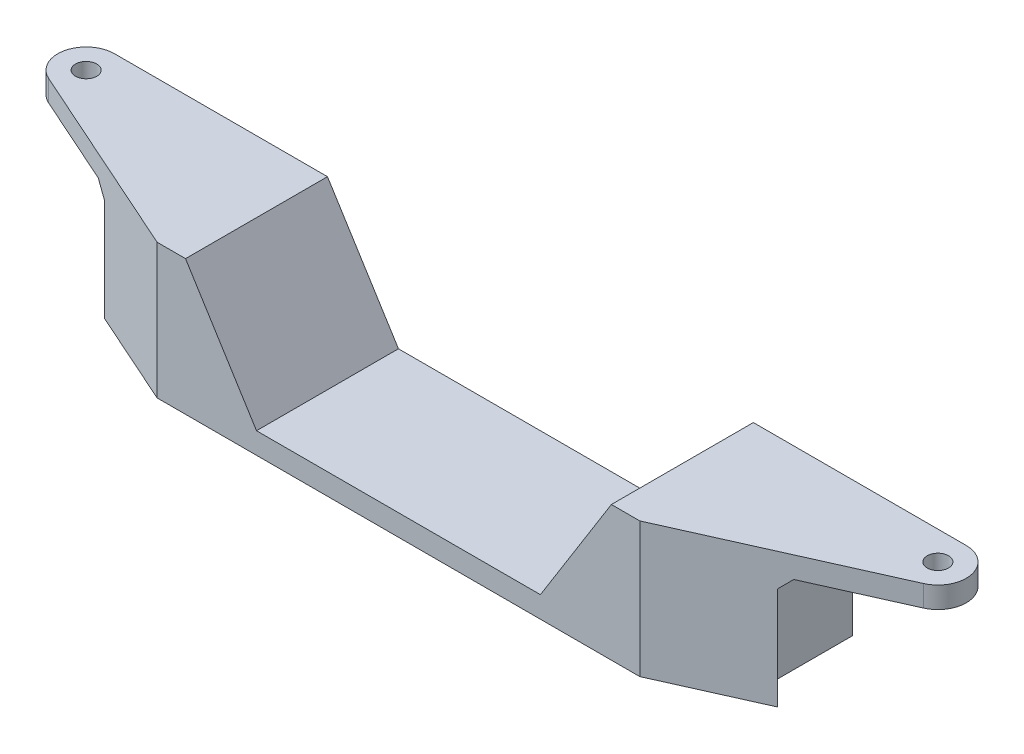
ISO-10303-21;
HEADER;
FILE_DESCRIPTION(('STEP AP214'),'2;1');
FILE_NAME('part.step','',(''),(''),'','','');
FILE_SCHEMA(('AUTOMOTIVE_DESIGN { 1 0 10303 214 1 1 1 1 }'));
ENDSEC;
DATA;
#1=APPLICATION_CONTEXT('core data for automotive mechanical design processes');
#2=APPLICATION_PROTOCOL_DEFINITION('international standard','automotive_design',2000,#1);
#3=PRODUCT_CONTEXT('',#1,'mechanical');
#4=PRODUCT('Part','Part','',(#3));
#5=PRODUCT_RELATED_PRODUCT_CATEGORY('part','',(#4));
#6=PRODUCT_DEFINITION_FORMATION('','',#4);
#7=PRODUCT_DEFINITION_CONTEXT('part definition',#1,'design');
#8=PRODUCT_DEFINITION('design','',#6,#7);
#9=PRODUCT_DEFINITION_SHAPE('','',#8);
#10=(LENGTH_UNIT() NAMED_UNIT(*) SI_UNIT(.MILLI.,.METRE.));
#11=(NAMED_UNIT(*) PLANE_ANGLE_UNIT() SI_UNIT($,.RADIAN.));
#12=(NAMED_UNIT(*) SI_UNIT($,.STERADIAN.) SOLID_ANGLE_UNIT());
#13=UNCERTAINTY_MEASURE_WITH_UNIT(LENGTH_MEASURE(1.E-05),#10,'distance_accuracy_value','');
#14=(GEOMETRIC_REPRESENTATION_CONTEXT(3) GLOBAL_UNCERTAINTY_ASSIGNED_CONTEXT((#13)) GLOBAL_UNIT_ASSIGNED_CONTEXT((#10,
#11,#12)) REPRESENTATION_CONTEXT('',''));
#15=CARTESIAN_POINT('',(0.,0.,0.));
#16=DIRECTION('',(0.,0.,1.));
#17=DIRECTION('',(1.,0.,0.));
#18=AXIS2_PLACEMENT_3D('',#15,#16,#17);
#19=CARTESIAN_POINT('',(60.,-8.,-4.00000000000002));
#20=DIRECTION('',(0.,1.,0.));
#21=DIRECTION('',(-1.,0.,0.));
#22=AXIS2_PLACEMENT_3D('',#19,#20,#21);
#23=PLANE('',#22);
#24=DIRECTION('',(-0.912985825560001,0.,-0.407991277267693));
#25=VECTOR('',#24,1.);
#26=CARTESIAN_POINT('',(-34.,-8.00000000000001,16.));
#27=LINE('',#26,#25);
#28=CARTESIAN_POINT('',(-34.,-8.,16.));
#29=VERTEX_POINT('',#28);
#30=CARTESIAN_POINT('',(-47.4265491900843,-8.,10.));
#31=VERTEX_POINT('',#30);
#32=EDGE_CURVE('E169',#29,#31,#27,.T.);
#33=ORIENTED_EDGE('',*,*,#32,.T.);
#34=DIRECTION('',(-1.,0.,0.));
#35=VECTOR('',#34,1.);
#36=CARTESIAN_POINT('',(-64.,-8.,10.));
#37=LINE('',#36,#35);
#38=CARTESIAN_POINT('',(-44.,-8.,10.));
#39=VERTEX_POINT('',#38);
#40=EDGE_CURVE('E167',#39,#31,#37,.T.);
#41=ORIENTED_EDGE('',*,*,#40,.F.);
#42=DIRECTION('',(0.,0.,-1.));
#43=VECTOR('',#42,1.);
#44=CARTESIAN_POINT('',(-44.,-8.,10.));
#45=LINE('',#44,#43);
#46=CARTESIAN_POINT('',(-44.,-8.,-4.00000000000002));
#47=VERTEX_POINT('',#46);
#48=EDGE_CURVE('E11',#39,#47,#45,.T.);
#49=ORIENTED_EDGE('',*,*,#48,.T.);
#50=DIRECTION('',(1.,0.,0.));
#51=VECTOR('',#50,1.);
#52=CARTESIAN_POINT('',(-60.,-8.00000000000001,-4.00000000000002));
#53=LINE('',#52,#51);
#54=CARTESIAN_POINT('',(44.,-8.,-4.00000000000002));
#55=VERTEX_POINT('',#54);
#56=EDGE_CURVE('E46',#47,#55,#53,.T.);
#57=ORIENTED_EDGE('',*,*,#56,.T.);
#58=DIRECTION('',(0.,0.,-1.));
#59=VECTOR('',#58,1.);
#60=CARTESIAN_POINT('',(44.,-8.,10.));
#61=LINE('',#60,#59);
#62=CARTESIAN_POINT('',(44.,-8.,10.));
#63=VERTEX_POINT('',#62);
#64=EDGE_CURVE('E210',#63,#55,#61,.T.);
#65=ORIENTED_EDGE('',*,*,#64,.F.);
#66=DIRECTION('',(1.,0.,0.));
#67=VECTOR('',#66,1.);
#68=CARTESIAN_POINT('',(64.,-8.,10.));
#69=LINE('',#68,#67);
#70=CARTESIAN_POINT('',(47.4265491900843,-8.,10.));
#71=VERTEX_POINT('',#70);
#72=EDGE_CURVE('E38',#63,#71,#69,.T.);
#73=ORIENTED_EDGE('',*,*,#72,.T.);
#74=DIRECTION('',(-0.912985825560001,0.,0.407991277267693));
#75=VECTOR('',#74,1.);
#76=CARTESIAN_POINT('',(34.,-8.,16.));
#77=LINE('',#76,#75);
#78=CARTESIAN_POINT('',(34.,-8.,16.));
#79=VERTEX_POINT('',#78);
#80=EDGE_CURVE('E292',#71,#79,#77,.T.);
#81=ORIENTED_EDGE('',*,*,#80,.T.);
#82=DIRECTION('',(-1.,0.,0.));
#83=VECTOR('',#82,1.);
#84=CARTESIAN_POINT('',(-34.,-8.00000000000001,16.));
#85=LINE('',#84,#83);
#86=EDGE_CURVE('E33',#79,#29,#85,.T.);
#87=ORIENTED_EDGE('',*,*,#86,.T.);
#88=EDGE_LOOP('',(#33,#41,#49,#57,#65,#73,#81,#87));
#89=FACE_BOUND('',#88,.T.);
#90=ADVANCED_FACE('F30',(#89),#23,.F.);
#91=CARTESIAN_POINT('',(-60.,-18.,0.));
#92=DIRECTION('',(0.,1.,0.));
#93=DIRECTION('',(0.,0.,1.));
#94=AXIS2_PLACEMENT_3D('',#91,#92,#93);
#95=CYLINDRICAL_SURFACE('',#94,1.5);
#96=CARTESIAN_POINT('',(-60.,11.,0.));
#97=DIRECTION('',(0.,-1.,0.));
#98=DIRECTION('',(0.,0.,1.));
#99=AXIS2_PLACEMENT_3D('',#96,#97,#98);
#100=CIRCLE('',#99,1.5);
#101=CARTESIAN_POINT('',(-60.,11.,1.49999999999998));
#102=VERTEX_POINT('',#101);
#103=EDGE_CURVE('E326',#102,#102,#100,.T.);
#104=ORIENTED_EDGE('',*,*,#103,.F.);
#105=EDGE_LOOP('',(#104));
#106=FACE_BOUND('',#105,.T.);
#107=CARTESIAN_POINT('',(-60.,8.,0.));
#108=DIRECTION('',(0.,1.,0.));
#109=DIRECTION('',(-1.,0.,0.));
#110=AXIS2_PLACEMENT_3D('',#107,#108,#109);
#111=CIRCLE('',#110,1.5);
#112=CARTESIAN_POINT('',(-61.5,8.,0.));
#113=VERTEX_POINT('',#112);
#114=EDGE_CURVE('E321',#113,#113,#111,.F.);
#115=ORIENTED_EDGE('',*,*,#114,.T.);
#116=EDGE_LOOP('',(#115));
#117=FACE_BOUND('',#116,.T.);
#118=ADVANCED_FACE('F330',(#106,#117),#95,.F.);
#119=CARTESIAN_POINT('',(60.,-18.,0.));
#120=DIRECTION('',(0.,1.,0.));
#121=DIRECTION('',(0.,0.,1.));
#122=AXIS2_PLACEMENT_3D('',#119,#120,#121);
#123=CYLINDRICAL_SURFACE('',#122,1.5);
#124=CARTESIAN_POINT('',(60.,8.,0.));
#125=DIRECTION('',(0.,-1.,0.));
#126=DIRECTION('',(1.,0.,0.));
#127=AXIS2_PLACEMENT_3D('',#124,#125,#126);
#128=CIRCLE('',#127,1.5);
#129=CARTESIAN_POINT('',(61.5,8.,0.));
#130=VERTEX_POINT('',#129);
#131=EDGE_CURVE('E186',#130,#130,#128,.T.);
#132=ORIENTED_EDGE('',*,*,#131,.T.);
#133=EDGE_LOOP('',(#132));
#134=FACE_BOUND('',#133,.T.);
#135=CARTESIAN_POINT('',(60.,11.,0.));
#136=DIRECTION('',(0.,1.,0.));
#137=DIRECTION('',(0.,0.,1.));
#138=AXIS2_PLACEMENT_3D('',#135,#136,#137);
#139=CIRCLE('',#138,1.5);
#140=CARTESIAN_POINT('',(60.,11.,1.49999999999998));
#141=VERTEX_POINT('',#140);
#142=EDGE_CURVE('E180',#141,#141,#139,.T.);
#143=ORIENTED_EDGE('',*,*,#142,.T.);
#144=EDGE_LOOP('',(#143));
#145=FACE_BOUND('',#144,.T.);
#146=ADVANCED_FACE('F333',(#134,#145),#123,.F.);
#147=CARTESIAN_POINT('',(-64.,8.,10.));
#148=DIRECTION('',(0.,1.,0.));
#149=DIRECTION('',(-1.,0.,0.));
#150=AXIS2_PLACEMENT_3D('',#147,#148,#149);
#151=PLANE('',#150);
#152=DIRECTION('',(1.,0.,0.));
#153=VECTOR('',#152,1.);
#154=CARTESIAN_POINT('',(-64.,8.,-4.00000000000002));
#155=LINE('',#154,#153);
#156=CARTESIAN_POINT('',(-60.,8.,-4.00000000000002));
#157=VERTEX_POINT('',#156);
#158=CARTESIAN_POINT('',(-49.,8.,-4.00000000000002));
#159=VERTEX_POINT('',#158);
#160=EDGE_CURVE('E173',#157,#159,#155,.T.);
#161=ORIENTED_EDGE('',*,*,#160,.T.);
#162=DIRECTION('',(0.,0.,1.));
#163=VECTOR('',#162,1.);
#164=CARTESIAN_POINT('',(-49.,8.,10.));
#165=LINE('',#164,#163);
#166=CARTESIAN_POINT('',(-49.,8.,9.29686290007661));
#167=VERTEX_POINT('',#166);
#168=EDGE_CURVE('E284',#159,#167,#165,.T.);
#169=ORIENTED_EDGE('',*,*,#168,.T.);
#170=DIRECTION('',(-0.912985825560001,0.,-0.407991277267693));
#171=VECTOR('',#170,1.);
#172=CARTESIAN_POINT('',(-34.,8.,16.));
#173=LINE('',#172,#171);
#174=CARTESIAN_POINT('',(-61.6319651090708,8.,3.65194330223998));
#175=VERTEX_POINT('',#174);
#176=EDGE_CURVE('E280',#167,#175,#173,.T.);
#177=ORIENTED_EDGE('',*,*,#176,.T.);
#178=CARTESIAN_POINT('',(-60.,8.,0.));
#179=DIRECTION('',(0.,1.,0.));
#180=DIRECTION('',(-1.,0.,0.));
#181=AXIS2_PLACEMENT_3D('',#178,#179,#180);
#182=CIRCLE('',#181,4.);
#183=EDGE_CURVE('E178',#175,#157,#182,.F.);
#184=ORIENTED_EDGE('',*,*,#183,.T.);
#185=EDGE_LOOP('',(#161,#169,#177,#184));
#186=FACE_BOUND('',#185,.T.);
#187=ORIENTED_EDGE('',*,*,#114,.F.);
#188=EDGE_LOOP('',(#187));
#189=FACE_BOUND('',#188,.T.);
#190=ADVANCED_FACE('F317',(#186,#189),#151,.F.);
#191=CARTESIAN_POINT('',(-60.,11.,0.));
#192=DIRECTION('',(0.,-1.,0.));
#193=DIRECTION('',(0.,0.,-1.));
#194=AXIS2_PLACEMENT_3D('',#191,#192,#193);
#195=CYLINDRICAL_SURFACE('',#194,4.);
#196=ORIENTED_EDGE('',*,*,#183,.F.);
#197=DIRECTION('',(0.,-1.,0.));
#198=VECTOR('',#197,1.);
#199=CARTESIAN_POINT('',(-61.6319651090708,11.,3.65194330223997));
#200=LINE('',#199,#198);
#201=CARTESIAN_POINT('',(-61.6319651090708,11.,3.65194330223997));
#202=VERTEX_POINT('',#201);
#203=EDGE_CURVE('E248',#202,#175,#200,.T.);
#204=ORIENTED_EDGE('',*,*,#203,.F.);
#205=CARTESIAN_POINT('',(-60.,11.,0.));
#206=DIRECTION('',(0.,-1.,0.));
#207=DIRECTION('',(0.,0.,-1.));
#208=AXIS2_PLACEMENT_3D('',#205,#206,#207);
#209=CIRCLE('',#208,4.);
#210=CARTESIAN_POINT('',(-60.,11.,-4.00000000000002));
#211=VERTEX_POINT('',#210);
#212=EDGE_CURVE('E227',#202,#211,#209,.T.);
#213=ORIENTED_EDGE('',*,*,#212,.T.);
#214=DIRECTION('',(0.,-1.,0.));
#215=VECTOR('',#214,1.);
#216=CARTESIAN_POINT('',(-60.,11.,-4.00000000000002));
#217=LINE('',#216,#215);
#218=EDGE_CURVE('E245',#211,#157,#217,.T.);
#219=ORIENTED_EDGE('',*,*,#218,.T.);
#220=EDGE_LOOP('',(#196,#204,#213,#219));
#221=FACE_BOUND('',#220,.T.);
#222=ADVANCED_FACE('F313',(#221),#195,.T.);
#223=CARTESIAN_POINT('',(60.,11.,0.));
#224=DIRECTION('',(0.,-1.,0.));
#225=DIRECTION('',(0.,0.,-1.));
#226=AXIS2_PLACEMENT_3D('',#223,#224,#225);
#227=CYLINDRICAL_SURFACE('',#226,4.);
#228=CARTESIAN_POINT('',(60.,8.,0.));
#229=DIRECTION('',(0.,-1.,0.));
#230=DIRECTION('',(1.,0.,0.));
#231=AXIS2_PLACEMENT_3D('',#228,#229,#230);
#232=CIRCLE('',#231,4.);
#233=CARTESIAN_POINT('',(61.6319651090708,8.,3.65194330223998));
#234=VERTEX_POINT('',#233);
#235=CARTESIAN_POINT('',(60.,8.,-4.00000000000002));
#236=VERTEX_POINT('',#235);
#237=EDGE_CURVE('E213',#234,#236,#232,.F.);
#238=ORIENTED_EDGE('',*,*,#237,.T.);
#239=DIRECTION('',(0.,-1.,0.));
#240=VECTOR('',#239,1.);
#241=CARTESIAN_POINT('',(60.,11.,-4.00000000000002));
#242=LINE('',#241,#240);
#243=CARTESIAN_POINT('',(60.,11.,-4.00000000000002));
#244=VERTEX_POINT('',#243);
#245=EDGE_CURVE('E242',#244,#236,#242,.T.);
#246=ORIENTED_EDGE('',*,*,#245,.F.);
#247=CARTESIAN_POINT('',(60.,11.,0.));
#248=DIRECTION('',(0.,-1.,0.));
#249=DIRECTION('',(0.,0.,1.));
#250=AXIS2_PLACEMENT_3D('',#247,#248,#249);
#251=CIRCLE('',#250,4.);
#252=CARTESIAN_POINT('',(61.6319651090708,11.,3.65194330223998));
#253=VERTEX_POINT('',#252);
#254=EDGE_CURVE('E234',#244,#253,#251,.T.);
#255=ORIENTED_EDGE('',*,*,#254,.T.);
#256=DIRECTION('',(0.,-1.,0.));
#257=VECTOR('',#256,1.);
#258=CARTESIAN_POINT('',(61.6319651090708,11.,3.65194330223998));
#259=LINE('',#258,#257);
#260=EDGE_CURVE('E238',#253,#234,#259,.T.);
#261=ORIENTED_EDGE('',*,*,#260,.T.);
#262=EDGE_LOOP('',(#238,#246,#255,#261));
#263=FACE_BOUND('',#262,.T.);
#264=ADVANCED_FACE('F342',(#263),#227,.T.);
#265=CARTESIAN_POINT('',(64.,8.,10.));
#266=DIRECTION('',(0.,-1.,0.));
#267=DIRECTION('',(1.,0.,0.));
#268=AXIS2_PLACEMENT_3D('',#265,#266,#267);
#269=PLANE('',#268);
#270=ORIENTED_EDGE('',*,*,#131,.F.);
#271=EDGE_LOOP('',(#270));
#272=FACE_BOUND('',#271,.T.);
#273=DIRECTION('',(0.912985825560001,0.,-0.407991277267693));
#274=VECTOR('',#273,1.);
#275=CARTESIAN_POINT('',(34.,8.,16.));
#276=LINE('',#275,#274);
#277=CARTESIAN_POINT('',(49.,8.,9.29686290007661));
#278=VERTEX_POINT('',#277);
#279=EDGE_CURVE('E215',#278,#234,#276,.T.);
#280=ORIENTED_EDGE('',*,*,#279,.F.);
#281=DIRECTION('',(0.,0.,-1.));
#282=VECTOR('',#281,1.);
#283=CARTESIAN_POINT('',(49.,8.,-4.00000000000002));
#284=LINE('',#283,#282);
#285=CARTESIAN_POINT('',(49.,8.,-4.00000000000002));
#286=VERTEX_POINT('',#285);
#287=EDGE_CURVE('E267',#278,#286,#284,.T.);
#288=ORIENTED_EDGE('',*,*,#287,.T.);
#289=DIRECTION('',(-1.,0.,0.));
#290=VECTOR('',#289,1.);
#291=CARTESIAN_POINT('',(-60.,7.99999999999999,-4.00000000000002));
#292=LINE('',#291,#290);
#293=EDGE_CURVE('E257',#236,#286,#292,.T.);
#294=ORIENTED_EDGE('',*,*,#293,.F.);
#295=ORIENTED_EDGE('',*,*,#237,.F.);
#296=EDGE_LOOP('',(#280,#288,#294,#295));
#297=FACE_BOUND('',#296,.T.);
#298=ADVANCED_FACE('F396',(#272,#297),#269,.T.);
#299=CARTESIAN_POINT('',(60.,11.,0.));
#300=DIRECTION('',(0.,1.,0.));
#301=DIRECTION('',(0.,0.,1.));
#302=AXIS2_PLACEMENT_3D('',#299,#300,#301);
#303=PLANE('',#302);
#304=DIRECTION('',(0.,0.,1.));
#305=VECTOR('',#304,1.);
#306=CARTESIAN_POINT('',(-30.,11.,0.));
#307=LINE('',#306,#305);
#308=CARTESIAN_POINT('',(-30.,11.,-4.00000000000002));
#309=VERTEX_POINT('',#308);
#310=CARTESIAN_POINT('',(-30.,11.,16.));
#311=VERTEX_POINT('',#310);
#312=EDGE_CURVE('E265',#309,#311,#307,.T.);
#313=ORIENTED_EDGE('',*,*,#312,.F.);
#314=DIRECTION('',(1.,0.,0.));
#315=VECTOR('',#314,1.);
#316=CARTESIAN_POINT('',(-60.,11.,-4.00000000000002));
#317=LINE('',#316,#315);
#318=EDGE_CURVE('E231',#211,#309,#317,.T.);
#319=ORIENTED_EDGE('',*,*,#318,.F.);
#320=ORIENTED_EDGE('',*,*,#212,.F.);
#321=DIRECTION('',(-0.912985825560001,0.,-0.407991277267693));
#322=VECTOR('',#321,1.);
#323=CARTESIAN_POINT('',(-34.,11.,16.));
#324=LINE('',#323,#322);
#325=CARTESIAN_POINT('',(-34.,11.,16.));
#326=VERTEX_POINT('',#325);
#327=EDGE_CURVE('E224',#326,#202,#324,.T.);
#328=ORIENTED_EDGE('',*,*,#327,.F.);
#329=DIRECTION('',(-1.,0.,0.));
#330=VECTOR('',#329,1.);
#331=CARTESIAN_POINT('',(-34.,11.,16.));
#332=LINE('',#331,#330);
#333=EDGE_CURVE('E220',#311,#326,#332,.T.);
#334=ORIENTED_EDGE('',*,*,#333,.F.);
#335=EDGE_LOOP('',(#313,#319,#320,#328,#334));
#336=FACE_BOUND('',#335,.T.);
#337=ORIENTED_EDGE('',*,*,#103,.T.);
#338=EDGE_LOOP('',(#337));
#339=FACE_BOUND('',#338,.T.);
#340=ADVANCED_FACE('F305',(#336,#339),#303,.T.);
#341=CARTESIAN_POINT('',(-20.,-5.,-8.));
#342=DIRECTION('',(-0.847998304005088,-0.52999894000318,0.));
#343=DIRECTION('',(0.52999894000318,-0.847998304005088,0.));
#344=AXIS2_PLACEMENT_3D('',#341,#342,#343);
#345=PLANE('',#344);
#346=DIRECTION('',(-0.52999894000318,0.847998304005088,0.));
#347=VECTOR('',#346,1.);
#348=CARTESIAN_POINT('',(-38.4269662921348,24.4831460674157,-4.00000000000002));
#349=LINE('',#348,#347);
#350=CARTESIAN_POINT('',(-20.,-5.,-4.00000000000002));
#351=VERTEX_POINT('',#350);
#352=EDGE_CURVE('E203',#351,#309,#349,.T.);
#353=ORIENTED_EDGE('',*,*,#352,.T.);
#354=ORIENTED_EDGE('',*,*,#312,.T.);
#355=DIRECTION('',(0.52999894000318,-0.847998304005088,0.));
#356=VECTOR('',#355,1.);
#357=CARTESIAN_POINT('',(-20.,-5.,16.));
#358=LINE('',#357,#356);
#359=CARTESIAN_POINT('',(-20.,-5.,16.));
#360=VERTEX_POINT('',#359);
#361=EDGE_CURVE('E194',#311,#360,#358,.T.);
#362=ORIENTED_EDGE('',*,*,#361,.T.);
#363=DIRECTION('',(0.,0.,1.));
#364=VECTOR('',#363,1.);
#365=CARTESIAN_POINT('',(-20.,-5.,-8.));
#366=LINE('',#365,#364);
#367=EDGE_CURVE('E198',#351,#360,#366,.T.);
#368=ORIENTED_EDGE('',*,*,#367,.F.);
#369=EDGE_LOOP('',(#353,#354,#362,#368));
#370=FACE_BOUND('',#369,.T.);
#371=ADVANCED_FACE('F381',(#370),#345,.F.);
#372=CARTESIAN_POINT('',(-20.,-5.,-8.));
#373=DIRECTION('',(0.,-1.,0.));
#374=DIRECTION('',(0.,0.,-1.));
#375=AXIS2_PLACEMENT_3D('',#372,#373,#374);
#376=PLANE('',#375);
#377=DIRECTION('',(-1.,0.,0.));
#378=VECTOR('',#377,1.);
#379=CARTESIAN_POINT('',(-60.,-5.,-4.00000000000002));
#380=LINE('',#379,#378);
#381=CARTESIAN_POINT('',(20.,-5.,-4.00000000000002));
#382=VERTEX_POINT('',#381);
#383=EDGE_CURVE('E205',#382,#351,#380,.T.);
#384=ORIENTED_EDGE('',*,*,#383,.T.);
#385=ORIENTED_EDGE('',*,*,#367,.T.);
#386=DIRECTION('',(1.,0.,0.));
#387=VECTOR('',#386,1.);
#388=CARTESIAN_POINT('',(-20.,-5.,16.));
#389=LINE('',#388,#387);
#390=CARTESIAN_POINT('',(20.,-5.,16.));
#391=VERTEX_POINT('',#390);
#392=EDGE_CURVE('E189',#360,#391,#389,.T.);
#393=ORIENTED_EDGE('',*,*,#392,.T.);
#394=DIRECTION('',(0.,0.,1.));
#395=VECTOR('',#394,1.);
#396=CARTESIAN_POINT('',(20.,-5.,-8.));
#397=LINE('',#396,#395);
#398=EDGE_CURVE('E197',#382,#391,#397,.T.);
#399=ORIENTED_EDGE('',*,*,#398,.F.);
#400=EDGE_LOOP('',(#384,#385,#393,#399));
#401=FACE_BOUND('',#400,.T.);
#402=ADVANCED_FACE('F384',(#401),#376,.F.);
#403=CARTESIAN_POINT('',(20.,-5.,-8.));
#404=DIRECTION('',(0.847998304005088,-0.52999894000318,0.));
#405=DIRECTION('',(0.52999894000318,0.847998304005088,0.));
#406=AXIS2_PLACEMENT_3D('',#403,#404,#405);
#407=PLANE('',#406);
#408=DIRECTION('',(-0.52999894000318,-0.847998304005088,0.));
#409=VECTOR('',#408,1.);
#410=CARTESIAN_POINT('',(4.7191011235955,-29.4494382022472,-4.00000000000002));
#411=LINE('',#410,#409);
#412=CARTESIAN_POINT('',(30.,11.,-4.00000000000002));
#413=VERTEX_POINT('',#412);
#414=EDGE_CURVE('E200',#413,#382,#411,.T.);
#415=ORIENTED_EDGE('',*,*,#414,.T.);
#416=ORIENTED_EDGE('',*,*,#398,.T.);
#417=DIRECTION('',(0.52999894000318,0.847998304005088,0.));
#418=VECTOR('',#417,1.);
#419=CARTESIAN_POINT('',(20.,-5.,16.));
#420=LINE('',#419,#418);
#421=CARTESIAN_POINT('',(30.,11.,16.));
#422=VERTEX_POINT('',#421);
#423=EDGE_CURVE('E192',#391,#422,#420,.T.);
#424=ORIENTED_EDGE('',*,*,#423,.T.);
#425=DIRECTION('',(0.,0.,-1.));
#426=VECTOR('',#425,1.);
#427=CARTESIAN_POINT('',(30.,11.,0.));
#428=LINE('',#427,#426);
#429=EDGE_CURVE('E263',#422,#413,#428,.T.);
#430=ORIENTED_EDGE('',*,*,#429,.T.);
#431=EDGE_LOOP('',(#415,#416,#424,#430));
#432=FACE_BOUND('',#431,.T.);
#433=ADVANCED_FACE('F386',(#432),#407,.F.);
#434=ORIENTED_EDGE('',*,*,#142,.F.);
#435=EDGE_LOOP('',(#434));
#436=FACE_BOUND('',#435,.T.);
#437=ORIENTED_EDGE('',*,*,#429,.F.);
#438=CARTESIAN_POINT('',(34.,11.,16.));
#439=VERTEX_POINT('',#438);
#440=EDGE_CURVE('E221',#439,#422,#332,.T.);
#441=ORIENTED_EDGE('',*,*,#440,.F.);
#442=DIRECTION('',(-0.912985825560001,0.,0.407991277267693));
#443=VECTOR('',#442,1.);
#444=CARTESIAN_POINT('',(34.,11.,16.));
#445=LINE('',#444,#443);
#446=EDGE_CURVE('E217',#253,#439,#445,.T.);
#447=ORIENTED_EDGE('',*,*,#446,.F.);
#448=ORIENTED_EDGE('',*,*,#254,.F.);
#449=EDGE_CURVE('E230',#413,#244,#317,.T.);
#450=ORIENTED_EDGE('',*,*,#449,.F.);
#451=EDGE_LOOP('',(#437,#441,#447,#448,#450));
#452=FACE_BOUND('',#451,.T.);
#453=ADVANCED_FACE('F378',(#436,#452),#303,.T.);
#454=CARTESIAN_POINT('',(-60.,11.,-4.00000000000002));
#455=DIRECTION('',(0.,0.,-1.));
#456=DIRECTION('',(-1.,0.,0.));
#457=AXIS2_PLACEMENT_3D('',#454,#455,#456);
#458=PLANE('',#457);
#459=ORIENTED_EDGE('',*,*,#56,.F.);
#460=DIRECTION('',(0.,-1.,0.));
#461=VECTOR('',#460,1.);
#462=CARTESIAN_POINT('',(-44.,8.,-4.00000000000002));
#463=LINE('',#462,#461);
#464=CARTESIAN_POINT('',(-44.,3.00000000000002,-4.00000000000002));
#465=VERTEX_POINT('',#464);
#466=EDGE_CURVE('E164',#465,#47,#463,.T.);
#467=ORIENTED_EDGE('',*,*,#466,.F.);
#468=DIRECTION('',(0.707106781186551,-0.707106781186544,0.));
#469=VECTOR('',#468,1.);
#470=CARTESIAN_POINT('',(-44.,3.00000000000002,-4.00000000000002));
#471=LINE('',#470,#469);
#472=EDGE_CURVE('E287',#465,#159,#471,.F.);
#473=ORIENTED_EDGE('',*,*,#472,.T.);
#474=ORIENTED_EDGE('',*,*,#160,.F.);
#475=ORIENTED_EDGE('',*,*,#218,.F.);
#476=ORIENTED_EDGE('',*,*,#318,.T.);
#477=ORIENTED_EDGE('',*,*,#352,.F.);
#478=ORIENTED_EDGE('',*,*,#383,.F.);
#479=ORIENTED_EDGE('',*,*,#414,.F.);
#480=ORIENTED_EDGE('',*,*,#449,.T.);
#481=ORIENTED_EDGE('',*,*,#245,.T.);
#482=ORIENTED_EDGE('',*,*,#293,.T.);
#483=DIRECTION('',(0.707106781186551,0.707106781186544,0.));
#484=VECTOR('',#483,1.);
#485=CARTESIAN_POINT('',(49.,8.,-4.00000000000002));
#486=LINE('',#485,#484);
#487=CARTESIAN_POINT('',(44.,3.00000000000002,-4.00000000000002));
#488=VERTEX_POINT('',#487);
#489=EDGE_CURVE('E274',#286,#488,#486,.F.);
#490=ORIENTED_EDGE('',*,*,#489,.T.);
#491=DIRECTION('',(0.,-1.,0.));
#492=VECTOR('',#491,1.);
#493=CARTESIAN_POINT('',(44.,11.,-4.00000000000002));
#494=LINE('',#493,#492);
#495=EDGE_CURVE('E241',#488,#55,#494,.T.);
#496=ORIENTED_EDGE('',*,*,#495,.T.);
#497=EDGE_LOOP('',(#459,#467,#473,#474,#475,#476,#477,#478,#479,#480,#481,#482,#490,#496));
#498=FACE_BOUND('',#497,.T.);
#499=ADVANCED_FACE('F320',(#498),#458,.T.);
#500=CARTESIAN_POINT('',(-44.,8.,10.));
#501=DIRECTION('',(1.,0.,0.));
#502=DIRECTION('',(0.,0.,-1.));
#503=AXIS2_PLACEMENT_3D('',#500,#501,#502);
#504=PLANE('',#503);
#505=DIRECTION('',(0.,-1.,0.));
#506=VECTOR('',#505,1.);
#507=CARTESIAN_POINT('',(-44.,8.,10.));
#508=LINE('',#507,#506);
#509=CARTESIAN_POINT('',(-44.,3.00000000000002,10.));
#510=VERTEX_POINT('',#509);
#511=EDGE_CURVE('E162',#510,#39,#508,.T.);
#512=ORIENTED_EDGE('',*,*,#511,.F.);
#513=DIRECTION('',(0.,0.,-1.));
#514=VECTOR('',#513,1.);
#515=CARTESIAN_POINT('',(-44.,3.00000000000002,-4.00000000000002));
#516=LINE('',#515,#514);
#517=EDGE_CURVE('E282',#510,#465,#516,.T.);
#518=ORIENTED_EDGE('',*,*,#517,.T.);
#519=ORIENTED_EDGE('',*,*,#466,.T.);
#520=ORIENTED_EDGE('',*,*,#48,.F.);
#521=EDGE_LOOP('',(#512,#518,#519,#520));
#522=FACE_BOUND('',#521,.T.);
#523=ADVANCED_FACE('F159',(#522),#504,.F.);
#524=CARTESIAN_POINT('',(-44.,3.00000000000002,10.));
#525=DIRECTION('',(-0.707106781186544,-0.707106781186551,0.));
#526=DIRECTION('',(0.707106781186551,-0.707106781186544,0.));
#527=AXIS2_PLACEMENT_3D('',#524,#525,#526);
#528=PLANE('',#527);
#529=DIRECTION('',(-0.67424614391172,0.674246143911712,-0.301304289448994));
#530=VECTOR('',#529,1.);
#531=CARTESIAN_POINT('',(-44.3110767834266,3.31107678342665,11.392229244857));
#532=LINE('',#531,#530);
#533=CARTESIAN_POINT('',(-47.4265491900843,6.42654919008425,10.));
#534=VERTEX_POINT('',#533);
#535=EDGE_CURVE('E289',#167,#534,#532,.F.);
#536=ORIENTED_EDGE('',*,*,#535,.F.);
#537=ORIENTED_EDGE('',*,*,#168,.F.);
#538=ORIENTED_EDGE('',*,*,#472,.F.);
#539=ORIENTED_EDGE('',*,*,#517,.F.);
#540=DIRECTION('',(-0.707106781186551,0.707106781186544,0.));
#541=VECTOR('',#540,1.);
#542=CARTESIAN_POINT('',(-48.5000000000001,7.50000000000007,10.));
#543=LINE('',#542,#541);
#544=EDGE_CURVE('E177',#534,#510,#543,.F.);
#545=ORIENTED_EDGE('',*,*,#544,.F.);
#546=EDGE_LOOP('',(#536,#537,#538,#539,#545));
#547=FACE_BOUND('',#546,.T.);
#548=ADVANCED_FACE('F368',(#547),#528,.T.);
#549=CARTESIAN_POINT('',(-34.,11.,16.));
#550=DIRECTION('',(-0.407991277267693,0.,0.912985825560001));
#551=DIRECTION('',(0.912985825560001,0.,0.407991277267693));
#552=AXIS2_PLACEMENT_3D('',#549,#550,#551);
#553=PLANE('',#552);
#554=ORIENTED_EDGE('',*,*,#32,.F.);
#555=DIRECTION('',(0.,-1.,0.));
#556=VECTOR('',#555,1.);
#557=CARTESIAN_POINT('',(-34.,11.,16.));
#558=LINE('',#557,#556);
#559=EDGE_CURVE('E251',#326,#29,#558,.T.);
#560=ORIENTED_EDGE('',*,*,#559,.F.);
#561=ORIENTED_EDGE('',*,*,#327,.T.);
#562=ORIENTED_EDGE('',*,*,#203,.T.);
#563=ORIENTED_EDGE('',*,*,#176,.F.);
#564=ORIENTED_EDGE('',*,*,#535,.T.);
#565=DIRECTION('',(0.,-1.,0.));
#566=VECTOR('',#565,1.);
#567=CARTESIAN_POINT('',(-47.4265491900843,11.,10.));
#568=LINE('',#567,#566);
#569=EDGE_CURVE('E278',#534,#31,#568,.T.);
#570=ORIENTED_EDGE('',*,*,#569,.T.);
#571=EDGE_LOOP('',(#554,#560,#561,#562,#563,#564,#570));
#572=FACE_BOUND('',#571,.T.);
#573=ADVANCED_FACE('F297',(#572),#553,.T.);
#574=CARTESIAN_POINT('',(-64.,-8.,10.));
#575=DIRECTION('',(0.,0.,-1.));
#576=DIRECTION('',(1.,0.,0.));
#577=AXIS2_PLACEMENT_3D('',#574,#575,#576);
#578=PLANE('',#577);
#579=ORIENTED_EDGE('',*,*,#569,.F.);
#580=ORIENTED_EDGE('',*,*,#544,.T.);
#581=ORIENTED_EDGE('',*,*,#511,.T.);
#582=ORIENTED_EDGE('',*,*,#40,.T.);
#583=EDGE_LOOP('',(#579,#580,#581,#582));
#584=FACE_BOUND('',#583,.T.);
#585=ADVANCED_FACE('F175',(#584),#578,.T.);
#586=CARTESIAN_POINT('',(34.,11.,16.));
#587=DIRECTION('',(0.407991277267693,0.,0.912985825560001));
#588=DIRECTION('',(0.912985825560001,0.,-0.407991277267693));
#589=AXIS2_PLACEMENT_3D('',#586,#587,#588);
#590=PLANE('',#589);
#591=ORIENTED_EDGE('',*,*,#80,.F.);
#592=DIRECTION('',(0.,1.,0.));
#593=VECTOR('',#592,1.);
#594=CARTESIAN_POINT('',(47.4265491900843,11.,10.));
#595=LINE('',#594,#593);
#596=CARTESIAN_POINT('',(47.4265491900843,6.42654919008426,10.));
#597=VERTEX_POINT('',#596);
#598=EDGE_CURVE('E260',#71,#597,#595,.T.);
#599=ORIENTED_EDGE('',*,*,#598,.T.);
#600=DIRECTION('',(-0.67424614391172,-0.674246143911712,0.301304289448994));
#601=VECTOR('',#600,1.);
#602=CARTESIAN_POINT('',(48.8571554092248,7.85715540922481,9.36069669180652));
#603=LINE('',#602,#601);
#604=EDGE_CURVE('E276',#597,#278,#603,.F.);
#605=ORIENTED_EDGE('',*,*,#604,.T.);
#606=ORIENTED_EDGE('',*,*,#279,.T.);
#607=ORIENTED_EDGE('',*,*,#260,.F.);
#608=ORIENTED_EDGE('',*,*,#446,.T.);
#609=DIRECTION('',(0.,-1.,0.));
#610=VECTOR('',#609,1.);
#611=CARTESIAN_POINT('',(34.,11.,16.));
#612=LINE('',#611,#610);
#613=EDGE_CURVE('E237',#439,#79,#612,.T.);
#614=ORIENTED_EDGE('',*,*,#613,.T.);
#615=EDGE_LOOP('',(#591,#599,#605,#606,#607,#608,#614));
#616=FACE_BOUND('',#615,.T.);
#617=ADVANCED_FACE('F361',(#616),#590,.T.);
#618=CARTESIAN_POINT('',(49.,8.,10.));
#619=DIRECTION('',(0.707106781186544,-0.707106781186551,0.));
#620=DIRECTION('',(0.707106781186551,0.707106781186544,0.));
#621=AXIS2_PLACEMENT_3D('',#618,#619,#620);
#622=PLANE('',#621);
#623=DIRECTION('',(-0.707106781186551,-0.707106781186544,0.));
#624=VECTOR('',#623,1.);
#625=CARTESIAN_POINT('',(48.5000000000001,7.50000000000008,10.));
#626=LINE('',#625,#624);
#627=CARTESIAN_POINT('',(44.,3.00000000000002,10.));
#628=VERTEX_POINT('',#627);
#629=EDGE_CURVE('E272',#628,#597,#626,.F.);
#630=ORIENTED_EDGE('',*,*,#629,.F.);
#631=DIRECTION('',(0.,0.,1.));
#632=VECTOR('',#631,1.);
#633=CARTESIAN_POINT('',(44.,3.00000000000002,10.));
#634=LINE('',#633,#632);
#635=EDGE_CURVE('E270',#488,#628,#634,.T.);
#636=ORIENTED_EDGE('',*,*,#635,.F.);
#637=ORIENTED_EDGE('',*,*,#489,.F.);
#638=ORIENTED_EDGE('',*,*,#287,.F.);
#639=ORIENTED_EDGE('',*,*,#604,.F.);
#640=EDGE_LOOP('',(#630,#636,#637,#638,#639));
#641=FACE_BOUND('',#640,.T.);
#642=ADVANCED_FACE('F364',(#641),#622,.T.);
#643=CARTESIAN_POINT('',(44.,8.,10.));
#644=DIRECTION('',(1.,0.,0.));
#645=DIRECTION('',(0.,0.,-1.));
#646=AXIS2_PLACEMENT_3D('',#643,#644,#645);
#647=PLANE('',#646);
#648=ORIENTED_EDGE('',*,*,#495,.F.);
#649=ORIENTED_EDGE('',*,*,#635,.T.);
#650=DIRECTION('',(0.,-1.,0.));
#651=VECTOR('',#650,1.);
#652=CARTESIAN_POINT('',(44.,8.,10.));
#653=LINE('',#652,#651);
#654=EDGE_CURVE('E207',#628,#63,#653,.T.);
#655=ORIENTED_EDGE('',*,*,#654,.T.);
#656=ORIENTED_EDGE('',*,*,#64,.T.);
#657=EDGE_LOOP('',(#648,#649,#655,#656));
#658=FACE_BOUND('',#657,.T.);
#659=ADVANCED_FACE('F357',(#658),#647,.T.);
#660=CARTESIAN_POINT('',(64.,-8.,10.));
#661=DIRECTION('',(0.,0.,-1.));
#662=DIRECTION('',(-1.,0.,0.));
#663=AXIS2_PLACEMENT_3D('',#660,#661,#662);
#664=PLANE('',#663);
#665=ORIENTED_EDGE('',*,*,#654,.F.);
#666=ORIENTED_EDGE('',*,*,#629,.T.);
#667=ORIENTED_EDGE('',*,*,#598,.F.);
#668=ORIENTED_EDGE('',*,*,#72,.F.);
#669=EDGE_LOOP('',(#665,#666,#667,#668));
#670=FACE_BOUND('',#669,.T.);
#671=ADVANCED_FACE('F352',(#670),#664,.T.);
#672=CARTESIAN_POINT('',(-34.,11.,16.));
#673=DIRECTION('',(0.,0.,1.));
#674=DIRECTION('',(1.,0.,0.));
#675=AXIS2_PLACEMENT_3D('',#672,#673,#674);
#676=PLANE('',#675);
#677=ORIENTED_EDGE('',*,*,#86,.F.);
#678=ORIENTED_EDGE('',*,*,#613,.F.);
#679=ORIENTED_EDGE('',*,*,#440,.T.);
#680=ORIENTED_EDGE('',*,*,#423,.F.);
#681=ORIENTED_EDGE('',*,*,#392,.F.);
#682=ORIENTED_EDGE('',*,*,#361,.F.);
#683=ORIENTED_EDGE('',*,*,#333,.T.);
#684=ORIENTED_EDGE('',*,*,#559,.T.);
#685=EDGE_LOOP('',(#677,#678,#679,#680,#681,#682,#683,#684));
#686=FACE_BOUND('',#685,.T.);
#687=ADVANCED_FACE('F299',(#686),#676,.T.);
#688=CLOSED_SHELL('',(#90,#118,#146,#190,#222,#264,#298,#340,#371,#402,#433,#453,#499,#523,#548,
#573,#585,#617,#642,#659,#671,#687));
#689=MANIFOLD_SOLID_BREP('B2',#688);
#690=ADVANCED_BREP_SHAPE_REPRESENTATION('',(#18,#689),#14);
#691=SHAPE_DEFINITION_REPRESENTATION(#9,#690);
ENDSEC;
END-ISO-10303-21;
